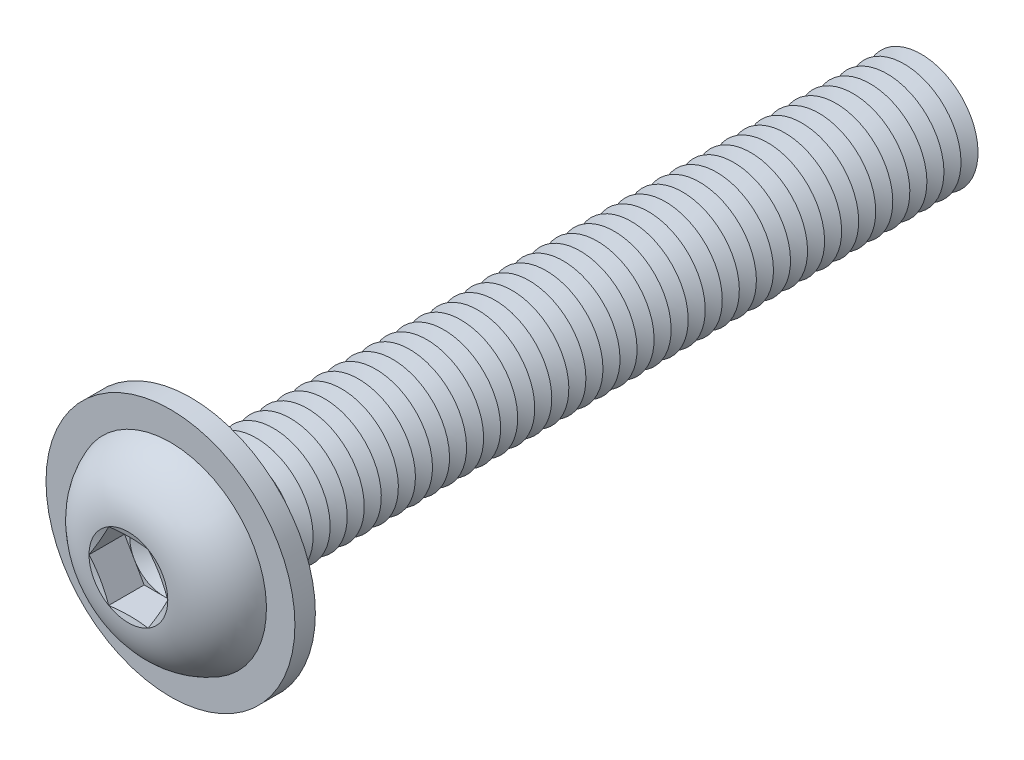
from build123d import *

# Parameters (mm, degrees)
FILLET1_R           = 0.75
LPATTERN1_COUNT     = 43
LPATTERN1_PITCH     = 1.5
CUT_EXTRUDE1_DEPTH  = 3.12
SKETCH5_R           = 10.95
SKETCH5_R_2         = 5.75
BOSS_EXTRUDE1_DEPTH = 1.8


with BuildPart() as part:
    # Sketch1 → Revolve1 (revolve)
    with BuildSketch(Plane(origin=(0, 0, 0), x_dir=(0, 0, -1), z_dir=(1, 0, 0))):
        with BuildLine():
            Line((0, 5), (0, 8.75))
            ThreePointArc((0, 8.75), (-3.814142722, 7.21429474), (-5.5, 3.4641))
            Line((-5.5, 3.4641), (-5.035898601, 1.73205))
            Line((-5.035898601, 1.73205), (-5.5, 1.73205))
            Line((-5.5, 1.73205), (-5.5, 0))
            Line((-5.5, 0), (65, 0))
            Line((65, 0), (65, 5))
            Line((65, 5), (0, 5))
        make_face()
    revolve(axis=Axis((0, 0, -65), (0, 0, 1)))

    # Fillet1
    fillet1_edges = [part.edges().sort_by_distance(p)[0] for p in [
        (0, -5, 0),
    ]]
    fillet(fillet1_edges, radius=FILLET1_R)

    # Sketch2 → Cut-Revolve1 (revolve, cut)
    with BuildSketch(Plane(origin=(0, 0, 0), x_dir=(0, 0, -1), z_dir=(1, 0, 0))):
        Polygon((64.25, 5), (65.75, 5), (65, 3.700961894), align=None)
    cut_revolve1 = revolve(axis=Axis((0, 0, -65), (0, 0, -1)), mode=Mode.SUBTRACT)

    # LPattern1: Cut-Revolve1 ×43
    with Locations(*[(0, 0, i * LPATTERN1_PITCH) for i in range(1, LPATTERN1_COUNT)]):
        add(cut_revolve1, mode=Mode.SUBTRACT)

    # Sketch3 → Cut-Extrude1 (cut)
    with BuildSketch(Plane.XY.offset(5.5)):
        Polygon((1.73205, 2.999998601), (-1.73205, 2.999998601), (-3.4641, 0), (-1.73205, -2.999998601), (1.73205, -2.999998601), (3.4641, 0), align=None)
    extrude(amount=-CUT_EXTRUDE1_DEPTH, mode=Mode.SUBTRACT)

    # Cut-Extrude2 cone 1 section (on through the dimple's axis) → Cut-Extrude2 (revolve, cut)
    with BuildSketch(Plane(origin=(0, 0, 2.38), x_dir=(0, -1, 0), z_dir=(1, 0, 0))):
        Polygon((0, 0), (2.999998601, 0), (0, 1.73205), align=None)
    revolve(axis=Axis((0, 0, 2.38), (0, 0, -1)), mode=Mode.SUBTRACT)

    # Sketch5 → Boss-Extrude1 (add)
    with BuildSketch(Plane(origin=(0, 0, 0), x_dir=(-1, 0, 0), z_dir=(0, 0, -1))):
        with Locations(Location((0, 0, 0), (0, 0, 90))):
            Circle(SKETCH5_R)
        Circle(SKETCH5_R_2, mode=Mode.SUBTRACT)
    extrude(amount=-BOSS_EXTRUDE1_DEPTH)


solid = part.part
